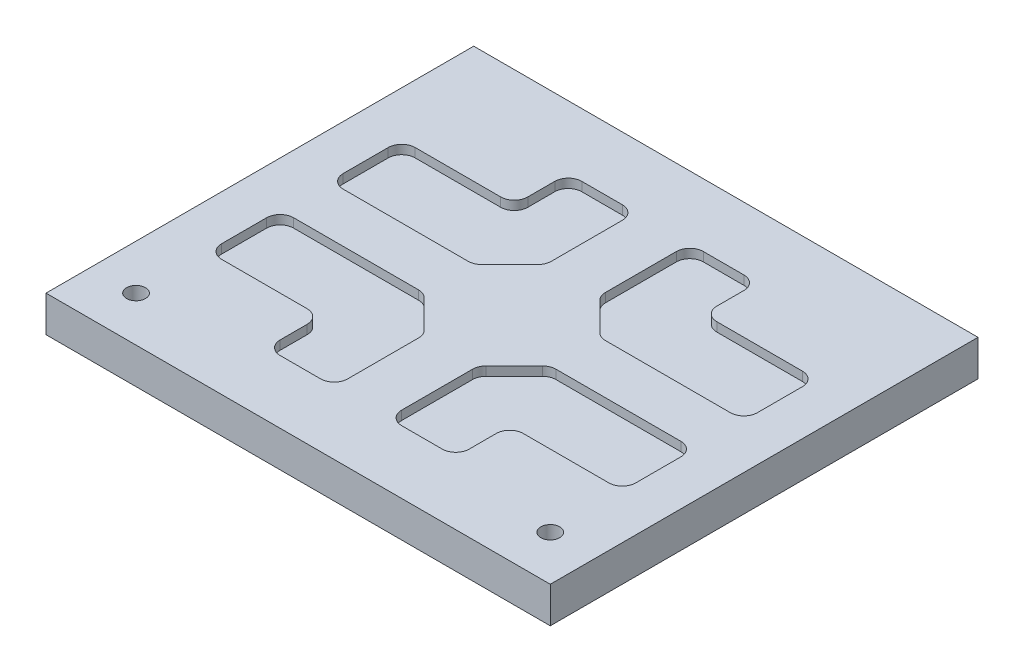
from build123d import *

# Parameters (mm, degrees)
SKETCH1_W              = 560
SKETCH1_H              = 475
BOSS_EXTRUDE1_DEPTH    = 40
CUT_EXTRUDE1_DEPTH     = 10
M24X3_0_TAPPED_HOLE1_D = 21


with BuildPart() as part:
    # Sketch1 → Boss-Extrude1 (new body)
    with BuildSketch(Plane(origin=(0, 0, 0), x_dir=(1, 0, 0), z_dir=(0, 1, 0))):
        Rectangle(SKETCH1_W, SKETCH1_H)
    extrude(amount=BOSS_EXTRUDE1_DEPTH)

    # Sketch7 → Cut-Extrude1 (cut)
    with BuildSketch(Plane(origin=(0, 40, 0), x_dir=(1, 0, 0), z_dir=(0, 1, 0))):
        with BuildLine():
            Line((-30, -152.5), (-30, -73.713203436))
            ThreePointArc((-30, -73.713203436), (-31.141807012, -67.97295195), (-34.393398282, -63.106601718))
            Line((-34.393398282, -63.106601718), (-65.606601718, -31.893398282))
            ThreePointArc((-65.606601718, -31.893398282), (-70.47295195, -28.641807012), (-76.213203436, -27.5))
            Line((-76.213203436, -27.5), (-215, -27.5))
            ThreePointArc((-215, -27.5), (-225.606601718, -31.893398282), (-230, -42.5))
            Line((-230, -42.5), (-230, -92.5))
            ThreePointArc((-230, -92.5), (-225.606601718, -103.106601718), (-215, -107.5))
            Line((-215, -107.5), (-120, -107.5))
            ThreePointArc((-120, -107.5), (-109.393398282, -111.893398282), (-105, -122.5))
            Line((-105, -122.5), (-105, -152.5))
            ThreePointArc((-105, -152.5), (-100.606601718, -163.106601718), (-90, -167.5))
            Line((-90, -167.5), (-45, -167.5))
            ThreePointArc((-45, -167.5), (-34.393398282, -163.106601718), (-30, -152.5))
        make_face()
        with BuildLine():
            Line((-105, 122.5), (-105, 152.5))
            ThreePointArc((-105, 152.5), (-100.606601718, 163.106601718), (-90, 167.5))
            Line((-90, 167.5), (-45, 167.5))
            ThreePointArc((-45, 167.5), (-34.393398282, 163.106601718), (-30, 152.5))
            Line((-30, 152.5), (-30, 73.713203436))
            ThreePointArc((-30, 73.713203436), (-31.141807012, 67.97295195), (-34.393398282, 63.106601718))
            Line((-34.393398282, 63.106601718), (-65.606601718, 31.893398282))
            ThreePointArc((-65.606601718, 31.893398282), (-70.47295195, 28.641807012), (-76.213203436, 27.5))
            Line((-76.213203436, 27.5), (-215, 27.5))
            ThreePointArc((-215, 27.5), (-225.606601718, 31.893398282), (-230, 42.5))
            Line((-230, 42.5), (-230, 92.5))
            ThreePointArc((-230, 92.5), (-225.606601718, 103.106601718), (-215, 107.5))
            Line((-215, 107.5), (-120, 107.5))
            ThreePointArc((-120, 107.5), (-109.393398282, 111.893398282), (-105, 122.5))
        make_face()
        with BuildLine():
            Line((215, 107.5), (120, 107.5))
            ThreePointArc((120, 107.5), (109.393398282, 111.893398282), (105, 122.5))
            Line((105, 122.5), (105, 152.5))
            ThreePointArc((105, 152.5), (100.606601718, 163.106601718), (90, 167.5))
            Line((90, 167.5), (45, 167.5))
            ThreePointArc((45, 167.5), (34.393398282, 163.106601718), (30, 152.5))
            Line((30, 152.5), (30, 73.713203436))
            ThreePointArc((30, 73.713203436), (31.141807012, 67.97295195), (34.393398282, 63.106601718))
            Line((34.393398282, 63.106601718), (65.606601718, 31.893398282))
            ThreePointArc((65.606601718, 31.893398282), (70.47295195, 28.641807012), (76.213203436, 27.5))
            Line((76.213203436, 27.5), (215, 27.5))
            ThreePointArc((215, 27.5), (225.606601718, 31.893398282), (230, 42.5))
            Line((230, 42.5), (230, 92.5))
            ThreePointArc((230, 92.5), (225.606601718, 103.106601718), (215, 107.5))
        make_face()
        with BuildLine():
            Line((105, -122.5), (105, -152.5))
            ThreePointArc((105, -152.5), (100.606601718, -163.106601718), (90, -167.5))
            Line((90, -167.5), (45, -167.5))
            ThreePointArc((45, -167.5), (34.393398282, -163.106601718), (30, -152.5))
            Line((30, -152.5), (30, -73.713203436))
            ThreePointArc((30, -73.713203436), (31.141807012, -67.97295195), (34.393398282, -63.106601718))
            Line((34.393398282, -63.106601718), (65.606601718, -31.893398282))
            ThreePointArc((65.606601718, -31.893398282), (70.47295195, -28.641807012), (76.213203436, -27.5))
            Line((76.213203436, -27.5), (215, -27.5))
            ThreePointArc((215, -27.5), (225.606601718, -31.893398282), (230, -42.5))
            Line((230, -42.5), (230, -92.5))
            ThreePointArc((230, -92.5), (225.606601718, -103.106601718), (215, -107.5))
            Line((215, -107.5), (120, -107.5))
            ThreePointArc((120, -107.5), (109.393398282, -111.893398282), (105, -122.5))
        make_face()
    extrude(amount=-CUT_EXTRUDE1_DEPTH, mode=Mode.SUBTRACT)

    # M24x3.0 Tapped Hole1 (through all)
    with Locations(Plane(origin=(0, 40, 0), x_dir=(1, 0, 0), z_dir=(0, 1, 0))):
        with Locations((-230, -187.5), (230, -187.5)):
            Hole(M24X3_0_TAPPED_HOLE1_D / 2)


solid = part.part
